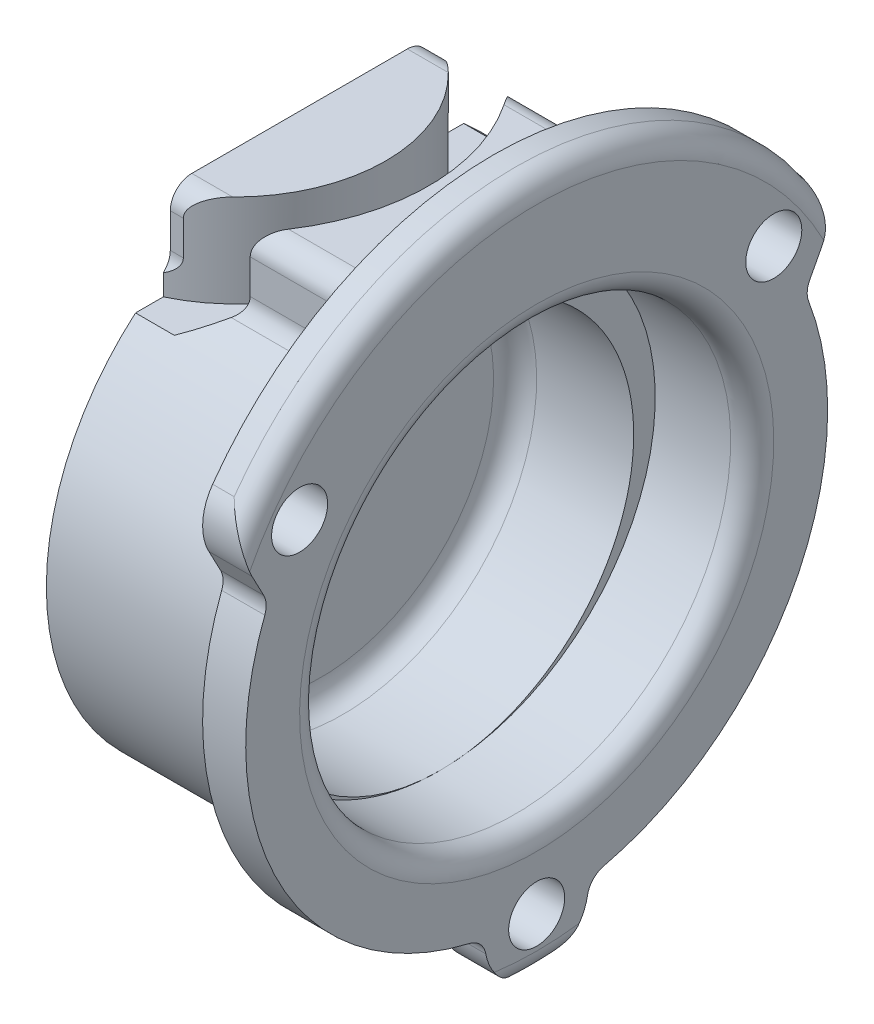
from build123d import *

# Parameters (mm, degrees)
SKETCH2_OUTSIDE_W  = 43.314
SKETCH2_OUTSIDE_H  = 43.314
CUT_EXTRUDE1_DEPTH = 25.351591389
SKETCH3_R          = 1.3
CUT_EXTRUDE2_DEPTH = 25.351591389
SKETCH5_R          = 9
SKETCH5_R_2        = 7
CUT_EXTRUDE3_DEPTH = 4.3


with BuildPart() as part:
    # Sketch1 → Revolve1 (revolve)
    with BuildSketch(Plane.XY):
        with BuildLine():
            Line((-2.5, 10), (-2.5, 0))
            Line((-2.5, 0), (-9, 0))
            Line((-9, 0), (-9, 16))
            Line((-9, 16), (1, 16))
            ThreePointArc((1, 16), (1.707106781, 15.707106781), (2, 15))
            Line((2, 15), (2, 11))
            ThreePointArc((2, 11), (1.707106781, 10.292893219), (1, 10))
            Line((1, 10), (-2.5, 10))
        make_face()
    revolve(axis=Axis((0, 0, 0), (-1, 0, 0)))

    # Sketch2 outside → Cut-Extrude1 (cut, through all)
    with BuildSketch(Plane(origin=(0, 0, 0), x_dir=(0, 0, -1), z_dir=(1, 0, 0))):
        Rectangle(SKETCH2_OUTSIDE_W, SKETCH2_OUTSIDE_H)
        with BuildLine():
            Line((5, 13.25), (-5, 13.25))
            ThreePointArc((-5, 13.25), (-5.707106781, 12.957106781), (-6, 12.25))
            Line((-6, 12.25), (-6, 10.656570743))
            ThreePointArc((-6, 10.656570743), (-6.119937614, 10.181712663), (-6.450980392, 9.820761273))
            ThreePointArc((-6.450980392, 9.820761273), (0, -11.75), (6.450980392, 9.820761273))
            ThreePointArc((6.450980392, 9.820761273), (6.119937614, 10.181712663), (6, 10.656570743))
            Line((6, 10.656570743), (6, 12.25))
            ThreePointArc((6, 12.25), (5.707106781, 12.957106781), (5, 13.25))
        make_face(mode=Mode.SUBTRACT)
    extrude(amount=-CUT_EXTRUDE1_DEPTH, mode=Mode.SUBTRACT)

    # Sketch3 → Cut-Extrude2 (cut, through all)
    with BuildSketch(Plane(origin=(0, 0, 0), x_dir=(0, 0, -1), z_dir=(1, 0, 0))):
        with Locations((-11, 7.829080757)):
            Circle(SKETCH3_R)
        with Locations((11, 7.829080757)):
            Circle(SKETCH3_R)
        with Locations((0, -13.501648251)):
            Circle(SKETCH3_R)
        with BuildLine():
            Line((-12.664898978, 5.629114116), (-13.210413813, 6.664678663))
            ThreePointArc((-13.210413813, 6.664678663), (-13.492769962, 7.995992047), (-13.035445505, 9.277777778))
            ThreePointArc((-13.035445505, 9.277777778), (0, -16), (13.035445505, 9.277777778))
            ThreePointArc((13.035445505, 9.277777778), (13.492769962, 7.995992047), (13.210413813, 6.664678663))
            Line((13.210413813, 6.664678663), (12.664898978, 5.629114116))
            ThreePointArc((12.664898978, 5.629114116), (12.551470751, 5.223399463), (12.615189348, 4.806973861))
            ThreePointArc((12.615189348, 4.806973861), (11.930739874, -6.317234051), (3.114633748, -13.135792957))
            ThreePointArc((3.114633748, -13.135792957), (2.619659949, -13.420790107), (2.361421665, -13.930236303))
            ThreePointArc((2.361421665, -13.930236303), (0, -15.901648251), (-2.361421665, -13.930236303))
            ThreePointArc((-2.361421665, -13.930236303), (-2.619659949, -13.420790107), (-3.114633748, -13.135792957))
            ThreePointArc((-3.114633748, -13.135792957), (-11.930739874, -6.317234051), (-12.615189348, 4.806973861))
            ThreePointArc((-12.615189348, 4.806973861), (-12.551470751, 5.223399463), (-12.664898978, 5.629114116))
        make_face()
    extrude(amount=CUT_EXTRUDE2_DEPTH, mode=Mode.SUBTRACT)

    # Sketch4 → Cut-Revolve1 (revolve, cut)
    with BuildSketch(Plane.XY, mode=Mode.PRIVATE) as cut_revolve1_sk:
        with BuildLine():
            Line((-2.5, -1), (-8, -1))
            Line((-8, -1), (-8, -9))
            ThreePointArc((-8, -9), (-7.707106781, -9.707106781), (-7, -10))
            Line((-7, -10), (-2.5, -10))
            Line((-2.5, -10), (-2.5, -1))
        make_face()
    revolve(cut_revolve1_sk.sketch.rotate(Axis((2, -1, 0), (-1, 0, 0)), 180), axis=Axis((2, -1, 0), (-1, 0, 0)), mode=Mode.SUBTRACT)

    # Sketch5 → Cut-Extrude3 (cut)
    with BuildSketch(Plane(origin=(0, 13.25, 0), x_dir=(-1, 0, 0), z_dir=(0, 1, 0))):
        with Locations((12, 0)):
            Circle(SKETCH5_R)
        with Locations((12, 0)):
            Circle(SKETCH5_R_2, mode=Mode.SUBTRACT)
    extrude(amount=-CUT_EXTRUDE3_DEPTH, mode=Mode.SUBTRACT)


solid = part.part
